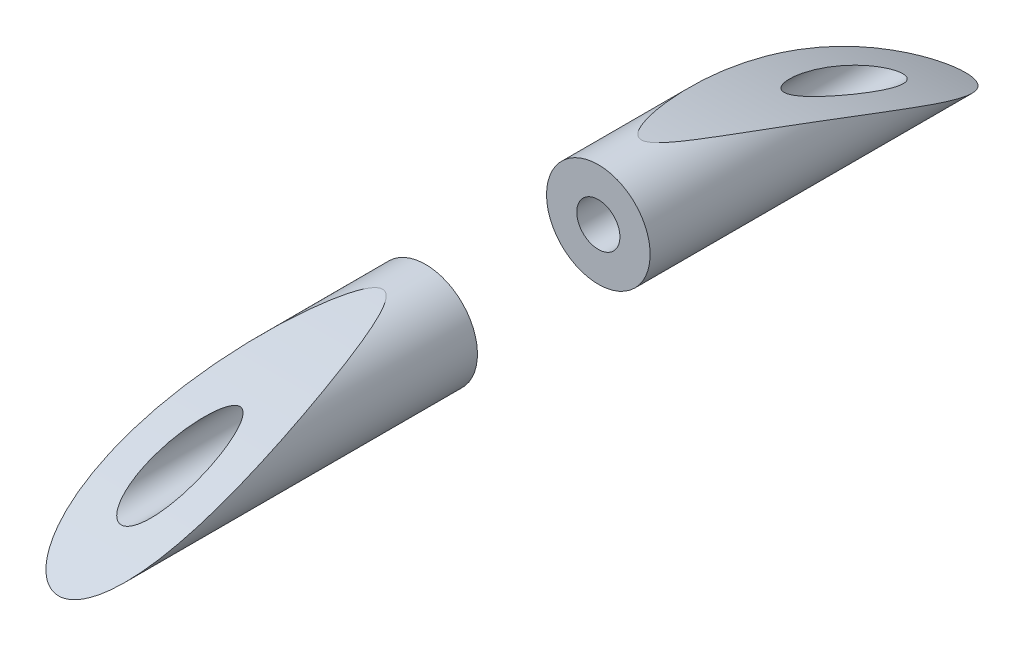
ISO-10303-21;
HEADER;
FILE_DESCRIPTION(('STEP AP214'),'2;1');
FILE_NAME('part.step','',(''),(''),'','','');
FILE_SCHEMA(('AUTOMOTIVE_DESIGN { 1 0 10303 214 1 1 1 1 }'));
ENDSEC;
DATA;
#1=APPLICATION_CONTEXT('core data for automotive mechanical design processes');
#2=APPLICATION_PROTOCOL_DEFINITION('international standard','automotive_design',2000,#1);
#3=PRODUCT_CONTEXT('',#1,'mechanical');
#4=PRODUCT('Part','Part','',(#3));
#5=PRODUCT_RELATED_PRODUCT_CATEGORY('part','',(#4));
#6=PRODUCT_DEFINITION_FORMATION('','',#4);
#7=PRODUCT_DEFINITION_CONTEXT('part definition',#1,'design');
#8=PRODUCT_DEFINITION('design','',#6,#7);
#9=PRODUCT_DEFINITION_SHAPE('','',#8);
#10=(LENGTH_UNIT() NAMED_UNIT(*) SI_UNIT(.MILLI.,.METRE.));
#11=(NAMED_UNIT(*) PLANE_ANGLE_UNIT() SI_UNIT($,.RADIAN.));
#12=(NAMED_UNIT(*) SI_UNIT($,.STERADIAN.) SOLID_ANGLE_UNIT());
#13=UNCERTAINTY_MEASURE_WITH_UNIT(LENGTH_MEASURE(1.E-05),#10,'distance_accuracy_value','');
#14=(GEOMETRIC_REPRESENTATION_CONTEXT(3) GLOBAL_UNCERTAINTY_ASSIGNED_CONTEXT((#13)) GLOBAL_UNIT_ASSIGNED_CONTEXT((#10,
#11,#12)) REPRESENTATION_CONTEXT('',''));
#15=CARTESIAN_POINT('',(0.,0.,0.));
#16=DIRECTION('',(0.,0.,1.));
#17=DIRECTION('',(1.,0.,0.));
#18=AXIS2_PLACEMENT_3D('',#15,#16,#17);
#19=CARTESIAN_POINT('',(0.,0.,10.5));
#20=DIRECTION('',(0.,0.,-1.));
#21=DIRECTION('',(-1.,0.,0.));
#22=AXIS2_PLACEMENT_3D('',#19,#20,#21);
#23=CYLINDRICAL_SURFACE('',#22,0.5);
#24=CARTESIAN_POINT('',(0.,0.,2.));
#25=DIRECTION('',(0.,0.,1.));
#26=DIRECTION('',(0.,-1.,0.));
#27=AXIS2_PLACEMENT_3D('',#24,#25,#26);
#28=CIRCLE('',#27,0.5);
#29=CARTESIAN_POINT('',(0.,-0.5,2.));
#30=VERTEX_POINT('',#29);
#31=EDGE_CURVE('E11',#30,#30,#28,.T.);
#32=ORIENTED_EDGE('',*,*,#31,.F.);
#33=EDGE_LOOP('',(#32));
#34=FACE_BOUND('',#33,.T.);
#35=CARTESIAN_POINT('',(-0.5,0.,7.81348853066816));
#36=CARTESIAN_POINT('',(-0.500001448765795,0.0291573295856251,7.73475115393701));
#37=CARTESIAN_POINT('',(-0.497465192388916,0.0578744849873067,7.65584777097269));
#38=CARTESIAN_POINT('',(-0.487597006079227,0.114324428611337,7.49800798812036));
#39=CARTESIAN_POINT('',(-0.48026587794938,0.142057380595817,7.4190715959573));
#40=CARTESIAN_POINT('',(-0.460633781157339,0.196628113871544,7.26094847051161));
#41=CARTESIAN_POINT('',(-0.448302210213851,0.223459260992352,7.18176323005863));
#42=CARTESIAN_POINT('',(-0.418091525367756,0.275902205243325,7.02413147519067));
#43=CARTESIAN_POINT('',(-0.40022022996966,0.301515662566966,6.94568407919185));
#44=CARTESIAN_POINT('',(-0.36795740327,0.33893520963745,6.82894699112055));
#45=CARTESIAN_POINT('',(-0.356254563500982,0.351273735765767,6.79008609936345));
#46=CARTESIAN_POINT('',(-0.330563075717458,0.375556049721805,6.71289235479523));
#47=CARTESIAN_POINT('',(-0.316569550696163,0.387498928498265,6.67456082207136));
#48=CARTESIAN_POINT('',(-0.285748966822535,0.410756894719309,6.59921824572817));
#49=CARTESIAN_POINT('',(-0.268947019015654,0.422076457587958,6.56219874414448));
#50=CARTESIAN_POINT('',(-0.240598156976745,0.438439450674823,6.50821051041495));
#51=CARTESIAN_POINT('',(-0.230644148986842,0.44378233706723,6.49050060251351));
#52=CARTESIAN_POINT('',(-0.20939341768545,0.454197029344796,6.45583050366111));
#53=CARTESIAN_POINT('',(-0.198098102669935,0.459269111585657,6.4388695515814));
#54=CARTESIAN_POINT('',(-0.173629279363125,0.469072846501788,6.40595294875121));
#55=CARTESIAN_POINT('',(-0.160437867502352,0.473800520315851,6.39000925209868));
#56=CARTESIAN_POINT('',(-0.13166804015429,0.482585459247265,6.36027398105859));
#57=CARTESIAN_POINT('',(-0.116107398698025,0.486647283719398,6.3464678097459));
#58=CARTESIAN_POINT('',(-0.0914505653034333,0.491625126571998,6.32950276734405));
#59=CARTESIAN_POINT('',(-0.0835964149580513,0.493031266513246,6.32470327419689));
#60=CARTESIAN_POINT('',(-0.0672596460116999,0.495524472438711,6.31618509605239));
#61=CARTESIAN_POINT('',(-0.0587769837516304,0.496611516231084,6.31246648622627));
#62=CARTESIAN_POINT('',(-0.0411612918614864,0.498382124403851,6.30640574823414));
#63=CARTESIAN_POINT('',(-0.0320216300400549,0.499060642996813,6.30408083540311));
#64=CARTESIAN_POINT('',(-0.0134492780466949,0.499905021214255,6.30118717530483));
#65=CARTESIAN_POINT('',(-0.00401712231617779,0.500071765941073,6.30061539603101));
#66=CARTESIAN_POINT('',(0.0136701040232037,0.499882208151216,6.3012651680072));
#67=CARTESIAN_POINT('',(0.0219340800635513,0.499584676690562,6.30228521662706));
#68=CARTESIAN_POINT('',(0.0381699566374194,0.498607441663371,6.30563344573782));
#69=CARTESIAN_POINT('',(0.0461415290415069,0.497927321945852,6.3079630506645));
#70=CARTESIAN_POINT('',(0.0645042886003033,0.495936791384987,6.31477496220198));
#71=CARTESIAN_POINT('',(0.074700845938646,0.494486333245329,6.31973466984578));
#72=CARTESIAN_POINT('',(0.0941618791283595,0.491153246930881,6.33111260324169));
#73=CARTESIAN_POINT('',(0.103423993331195,0.489269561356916,6.33753439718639));
#74=CARTESIAN_POINT('',(0.128190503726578,0.48356614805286,6.35693990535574));
#75=CARTESIAN_POINT('',(0.142723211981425,0.479407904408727,6.37104681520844));
#76=CARTESIAN_POINT('',(0.16966531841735,0.470546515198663,6.40098514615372));
#77=CARTESIAN_POINT('',(0.182067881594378,0.465841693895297,6.41682186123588));
#78=CARTESIAN_POINT('',(0.211578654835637,0.453446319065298,6.45836433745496));
#79=CARTESIAN_POINT('',(0.227594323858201,0.445519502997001,6.48476721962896));
#80=CARTESIAN_POINT('',(0.257083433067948,0.42917327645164,6.53883186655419));
#81=CARTESIAN_POINT('',(0.27055092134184,0.420752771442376,6.56649639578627));
#82=CARTESIAN_POINT('',(0.29564659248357,0.403516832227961,6.62272138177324));
#83=CARTESIAN_POINT('',(0.30726403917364,0.394699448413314,6.65128599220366));
#84=CARTESIAN_POINT('',(0.328967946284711,0.376798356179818,6.70886235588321));
#85=CARTESIAN_POINT('',(0.339056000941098,0.367714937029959,6.7378736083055));
#86=CARTESIAN_POINT('',(0.363256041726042,0.344192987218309,6.81246121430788));
#87=CARTESIAN_POINT('',(0.376483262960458,0.329587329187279,6.85827172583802));
#88=CARTESIAN_POINT('',(0.400532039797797,0.299894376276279,6.95036837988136));
#89=CARTESIAN_POINT('',(0.411352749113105,0.284806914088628,6.99665468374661));
#90=CARTESIAN_POINT('',(0.440779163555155,0.238845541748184,7.13610338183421));
#91=CARTESIAN_POINT('',(0.456304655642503,0.20731889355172,7.22970870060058));
#92=CARTESIAN_POINT('',(0.480375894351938,0.142866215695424,7.416946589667));
#93=CARTESIAN_POINT('',(0.488944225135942,0.109945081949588,7.51057807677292));
#94=CARTESIAN_POINT('',(0.499331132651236,0.0427370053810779,7.69773825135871));
#95=CARTESIAN_POINT('',(0.501150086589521,0.00845013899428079,7.79126694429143));
#96=CARTESIAN_POINT('',(0.49778461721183,-0.055033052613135,7.96094278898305));
#97=CARTESIAN_POINT('',(0.493802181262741,-0.0840344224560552,8.03718748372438));
#98=CARTESIAN_POINT('',(0.480147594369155,-0.142729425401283,8.18901450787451));
#99=CARTESIAN_POINT('',(0.470470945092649,-0.1724235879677,8.26459626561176));
#100=CARTESIAN_POINT('',(0.450272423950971,-0.218057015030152,8.37894755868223));
#101=CARTESIAN_POINT('',(0.442313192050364,-0.233861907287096,8.41822671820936));
#102=CARTESIAN_POINT('',(0.424080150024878,-0.265500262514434,8.49622611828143));
#103=CARTESIAN_POINT('',(0.41380722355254,-0.281333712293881,8.53494656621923));
#104=CARTESIAN_POINT('',(0.39047735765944,-0.312910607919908,8.61156646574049));
#105=CARTESIAN_POINT('',(0.377421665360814,-0.3286540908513,8.64946627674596));
#106=CARTESIAN_POINT('',(0.34781938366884,-0.359840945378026,8.72398115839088));
#107=CARTESIAN_POINT('',(0.331278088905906,-0.375284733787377,8.76059808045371));
#108=CARTESIAN_POINT('',(0.296744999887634,-0.402920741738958,8.8256638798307));
#109=CARTESIAN_POINT('',(0.27947392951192,-0.415220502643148,8.85444545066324));
#110=CARTESIAN_POINT('',(0.240711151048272,-0.438833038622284,8.90940169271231));
#111=CARTESIAN_POINT('',(0.219243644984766,-0.450150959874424,8.93559007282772));
#112=CARTESIAN_POINT('',(0.184263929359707,-0.464949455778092,8.96968174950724));
#113=CARTESIAN_POINT('',(0.173068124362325,-0.469257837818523,8.9795850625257));
#114=CARTESIAN_POINT('',(0.149414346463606,-0.477317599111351,8.99807948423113));
#115=CARTESIAN_POINT('',(0.136955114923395,-0.481068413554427,9.00666926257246));
#116=CARTESIAN_POINT('',(0.110538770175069,-0.487821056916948,9.02211225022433));
#117=CARTESIAN_POINT('',(0.0965631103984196,-0.490811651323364,9.02893943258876));
#118=CARTESIAN_POINT('',(0.0674345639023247,-0.495649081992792,9.03997314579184));
#119=CARTESIAN_POINT('',(0.0522858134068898,-0.497499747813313,9.04418845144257));
#120=CARTESIAN_POINT('',(0.0254925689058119,-0.499479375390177,9.04869637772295));
#121=CARTESIAN_POINT('',(0.0139969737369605,-0.499936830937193,9.04973751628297));
#122=CARTESIAN_POINT('',(-0.00902019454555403,-0.500050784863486,9.04999691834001));
#123=CARTESIAN_POINT('',(-0.0205417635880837,-0.499707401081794,9.04921545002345));
#124=CARTESIAN_POINT('',(-0.0432373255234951,-0.498256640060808,9.04591212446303));
#125=CARTESIAN_POINT('',(-0.05441232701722,-0.497151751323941,9.04339593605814));
#126=CARTESIAN_POINT('',(-0.0762163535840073,-0.494279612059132,9.03684981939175));
#127=CARTESIAN_POINT('',(-0.0868449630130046,-0.492511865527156,9.03281875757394));
#128=CARTESIAN_POINT('',(-0.112816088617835,-0.487368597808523,9.02107774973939));
#129=CARTESIAN_POINT('',(-0.127714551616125,-0.483635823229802,9.01254654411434));
#130=CARTESIAN_POINT('',(-0.155888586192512,-0.4753059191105,8.9934680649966));
#131=CARTESIAN_POINT('',(-0.169159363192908,-0.470706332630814,8.98291505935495));
#132=CARTESIAN_POINT('',(-0.20376782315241,-0.457212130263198,8.95187924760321));
#133=CARTESIAN_POINT('',(-0.223557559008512,-0.447713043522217,8.92995207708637));
#134=CARTESIAN_POINT('',(-0.259619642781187,-0.427809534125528,8.88378133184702));
#135=CARTESIAN_POINT('',(-0.275882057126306,-0.417402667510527,8.8595314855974));
#136=CARTESIAN_POINT('',(-0.307073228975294,-0.395103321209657,8.80730018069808));
#137=CARTESIAN_POINT('',(-0.321735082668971,-0.383162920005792,8.77918182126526));
#138=CARTESIAN_POINT('',(-0.348516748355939,-0.358970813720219,8.72187502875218));
#139=CARTESIAN_POINT('',(-0.360633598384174,-0.346718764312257,8.69268539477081));
#140=CARTESIAN_POINT('',(-0.393946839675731,-0.309706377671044,8.60396617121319));
#141=CARTESIAN_POINT('',(-0.412059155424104,-0.28472684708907,8.54337285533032));
#142=CARTESIAN_POINT('',(-0.440665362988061,-0.237646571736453,8.42770195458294));
#143=CARTESIAN_POINT('',(-0.451787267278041,-0.215538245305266,8.37277113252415));
#144=CARTESIAN_POINT('',(-0.470262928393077,-0.171532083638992,8.26216004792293));
#145=CARTESIAN_POINT('',(-0.477614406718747,-0.149634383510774,8.2064793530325));
#146=CARTESIAN_POINT('',(-0.489104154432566,-0.106207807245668,8.09474086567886));
#147=CARTESIAN_POINT('',(-0.493246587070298,-0.084678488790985,8.03868365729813));
#148=CARTESIAN_POINT('',(-0.498694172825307,-0.0420240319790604,7.92627559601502));
#149=CARTESIAN_POINT('',(-0.499998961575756,-0.0208989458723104,7.86992470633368));
#150=CARTESIAN_POINT('',(-0.5,0.,7.81348853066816));
#151=B_SPLINE_CURVE_WITH_KNOTS('',3,(#35,#36,#37,#38,#39,#40,#41,#42,#43,#44,#45,#46,#47,#48,
#49,#50,#51,#52,#53,#54,#55,#56,#57,#58,#59,#60,#61,#62,#63,#64,#65,#66,#67,#68,#69,#70,#71,#72,
#73,#74,#75,#76,#77,#78,#79,#80,#81,#82,#83,#84,#85,#86,#87,#88,#89,#90,#91,#92,#93,#94,#95,#96,
#97,#98,#99,#100,#101,#102,#103,#104,#105,#106,#107,#108,#109,#110,#111,#112,#113,#114,#115,
#116,#117,#118,#119,#120,#121,#122,#123,#124,#125,#126,#127,#128,#129,#130,#131,#132,#133,#134,
#135,#136,#137,#138,#139,#140,#141,#142,#143,#144,#145,#146,#147,#148,#149,#150),.UNSPECIFIED.,
.T.,.F.,(4,2,2,2,2,2,2,2,2,2,2,2,2,2,2,2,2,2,2,2,2,2,2,2,2,2,2,2,2,2,2,2,2,2,2,2,2,2,2,2,2,2,2,
2,2,2,2,2,2,2,2,2,2,2,2,2,2,4),(0.,0.251859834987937,0.503677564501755,0.757060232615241,
1.01008690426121,1.13729267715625,1.2647728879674,1.39116889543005,1.45414921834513,
1.51706399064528,1.58061748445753,1.64371576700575,1.67158102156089,1.69944821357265,
1.72765289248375,1.75580876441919,1.78067871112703,1.80557576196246,1.83967454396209,
1.87385745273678,1.9355364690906,1.99740984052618,2.09281557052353,2.18844146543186,
2.2846035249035,2.38066464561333,2.53018231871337,2.67975248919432,2.97937197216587,
3.27801490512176,3.57664114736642,3.8214999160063,4.06655237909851,4.19574643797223,
4.32489123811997,4.45397828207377,4.58287063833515,4.68992252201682,4.79637431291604,
4.84295482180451,4.88958219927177,4.93686310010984,4.98398428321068,5.018477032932,
5.05296470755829,5.08734021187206,5.12174149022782,5.17414641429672,5.22670217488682,
5.31925926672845,5.41207372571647,5.51356711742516,5.61517798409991,5.81871252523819,
5.9993394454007,6.18007539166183,6.36057646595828,6.541100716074),.UNSPECIFIED.);
#152=CARTESIAN_POINT('',(-0.5,0.,7.81348853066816));
#153=VERTEX_POINT('',#152);
#154=EDGE_CURVE('E47',#153,#153,#151,.T.);
#155=ORIENTED_EDGE('',*,*,#154,.F.);
#156=EDGE_LOOP('',(#155));
#157=FACE_BOUND('',#156,.T.);
#158=ADVANCED_FACE('F39',(#34,#157),#23,.F.);
#159=CARTESIAN_POINT('',(0.,0.,10.5));
#160=DIRECTION('',(0.,0.,-1.));
#161=DIRECTION('',(-1.,0.,0.));
#162=AXIS2_PLACEMENT_3D('',#159,#160,#161);
#163=CYLINDRICAL_SURFACE('',#162,1.2);
#164=CARTESIAN_POINT('',(0.,-1.19999999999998,10.5));
#165=CARTESIAN_POINT('',(-0.033764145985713,-1.19999774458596,10.499995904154));
#166=CARTESIAN_POINT('',(-0.0675697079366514,-1.19855851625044,10.4972694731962));
#167=CARTESIAN_POINT('',(-0.13414225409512,-1.19294985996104,10.4866291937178));
#168=CARTESIAN_POINT('',(-0.166906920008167,-1.18877473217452,10.4787045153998));
#169=CARTESIAN_POINT('',(-0.237566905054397,-1.1769071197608,10.4561262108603));
#170=CARTESIAN_POINT('',(-0.27501344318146,-1.16864440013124,10.4403786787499));
#171=CARTESIAN_POINT('',(-0.346515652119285,-1.14948018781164,10.403711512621));
#172=CARTESIAN_POINT('',(-0.380565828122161,-1.13857451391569,10.3827836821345));
#173=CARTESIAN_POINT('',(-0.462778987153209,-1.1084507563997,10.3247064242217));
#174=CARTESIAN_POINT('',(-0.508577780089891,-1.0879326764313,10.2849157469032));
#175=CARTESIAN_POINT('',(-0.593011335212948,-1.04431999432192,10.1996123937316));
#176=CARTESIAN_POINT('',(-0.63162737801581,-1.02121890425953,10.1540852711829));
#177=CARTESIAN_POINT('',(-0.700809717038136,-0.97493189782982,10.0620202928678));
#178=CARTESIAN_POINT('',(-0.731709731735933,-0.951826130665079,10.0156885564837));
#179=CARTESIAN_POINT('',(-0.789040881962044,-0.904869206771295,9.92066805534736));
#180=CARTESIAN_POINT('',(-0.815467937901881,-0.88101739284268,9.87197719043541));
#181=CARTESIAN_POINT('',(-0.864548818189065,-0.832909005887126,9.77283214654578));
#182=CARTESIAN_POINT('',(-0.887196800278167,-0.808651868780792,9.72237538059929));
#183=CARTESIAN_POINT('',(-0.92921262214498,-0.759996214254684,9.62017039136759));
#184=CARTESIAN_POINT('',(-0.948579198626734,-0.735597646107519,9.5684216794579));
#185=CARTESIAN_POINT('',(-1.00582822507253,-0.657820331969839,9.40177953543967));
#186=CARTESIAN_POINT('',(-1.0383294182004,-0.604495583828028,9.28500377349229));
#187=CARTESIAN_POINT('',(-1.09294276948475,-0.498989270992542,9.04851051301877));
#188=CARTESIAN_POINT('',(-1.11504307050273,-0.446809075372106,8.92878981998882));
#189=CARTESIAN_POINT('',(-1.15092913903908,-0.343994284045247,8.68711353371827));
#190=CARTESIAN_POINT('',(-1.16469363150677,-0.293363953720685,8.56515303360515));
#191=CARTESIAN_POINT('',(-1.18528100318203,-0.194098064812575,8.31993202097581));
#192=CARTESIAN_POINT('',(-1.19210685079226,-0.145461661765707,8.1966720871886));
#193=CARTESIAN_POINT('',(-1.20034460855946,-0.044818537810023,7.93484668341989));
#194=CARTESIAN_POINT('',(-1.20103915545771,0.00692751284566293,7.79615961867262));
#195=CARTESIAN_POINT('',(-1.19622454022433,0.107644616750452,7.5178703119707));
#196=CARTESIAN_POINT('',(-1.19071400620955,0.156615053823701,7.37826787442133));
#197=CARTESIAN_POINT('',(-1.17428914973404,0.251747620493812,7.09827358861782));
#198=CARTESIAN_POINT('',(-1.16336929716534,0.297906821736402,6.95788107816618));
#199=CARTESIAN_POINT('',(-1.13672844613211,0.387330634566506,6.6766159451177));
#200=CARTESIAN_POINT('',(-1.12100681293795,0.430594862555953,6.53574326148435));
#201=CARTESIAN_POINT('',(-1.08521080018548,0.514182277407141,6.25376678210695));
#202=CARTESIAN_POINT('',(-1.06513878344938,0.554507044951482,6.1126631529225));
#203=CARTESIAN_POINT('',(-1.02092224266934,0.632231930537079,5.83030489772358));
#204=CARTESIAN_POINT('',(-0.996778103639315,0.669632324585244,5.68905028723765));
#205=CARTESIAN_POINT('',(-0.944548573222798,0.74148451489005,5.40663888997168));
#206=CARTESIAN_POINT('',(-0.916466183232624,0.775938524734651,5.26548211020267));
#207=CARTESIAN_POINT('',(-0.856248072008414,0.841925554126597,4.98336297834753));
#208=CARTESIAN_POINT('',(-0.824112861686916,0.87345894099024,4.84240060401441));
#209=CARTESIAN_POINT('',(-0.770787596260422,0.920062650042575,4.62430219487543));
#210=CARTESIAN_POINT('',(-0.751181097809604,0.936154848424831,4.54699443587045));
#211=CARTESIAN_POINT('',(-0.710424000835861,0.967449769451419,4.39260202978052));
#212=CARTESIAN_POINT('',(-0.689273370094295,0.98265247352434,4.31551738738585));
#213=CARTESIAN_POINT('',(-0.645187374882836,1.01214438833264,4.16176680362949));
#214=CARTESIAN_POINT('',(-0.622253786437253,1.02643448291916,4.08510052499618));
#215=CARTESIAN_POINT('',(-0.574149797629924,1.05409873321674,3.93231060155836));
#216=CARTESIAN_POINT('',(-0.548979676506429,1.06747300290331,3.85618689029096));
#217=CARTESIAN_POINT('',(-0.503394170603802,1.08951177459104,3.72688531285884));
#218=CARTESIAN_POINT('',(-0.483731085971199,1.09841287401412,3.67348615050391));
#219=CARTESIAN_POINT('',(-0.442389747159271,1.11570099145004,3.56744796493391));
#220=CARTESIAN_POINT('',(-0.420713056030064,1.12408839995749,3.51480838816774));
#221=CARTESIAN_POINT('',(-0.368431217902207,1.14247427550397,3.39675235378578));
#222=CARTESIAN_POINT('',(-0.336983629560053,1.15230917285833,3.33165461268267));
#223=CARTESIAN_POINT('',(-0.283516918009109,1.16616801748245,3.23728000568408));
#224=CARTESIAN_POINT('',(-0.264609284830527,1.17064531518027,3.20631910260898));
#225=CARTESIAN_POINT('',(-0.223621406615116,1.17916972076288,3.1465349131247));
#226=CARTESIAN_POINT('',(-0.201554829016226,1.1832185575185,3.11770318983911));
#227=CARTESIAN_POINT('',(-0.167734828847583,1.18825396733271,3.08140182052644));
#228=CARTESIAN_POINT('',(-0.158231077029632,1.18956409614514,3.07190774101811));
#229=CARTESIAN_POINT('',(-0.138312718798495,1.19204497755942,3.05385246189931));
#230=CARTESIAN_POINT('',(-0.127896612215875,1.19321549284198,3.04529285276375));
#231=CARTESIAN_POINT('',(-0.105870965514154,1.19537253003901,3.02946070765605));
#232=CARTESIAN_POINT('',(-0.0942472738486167,1.19635636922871,3.0222070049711));
#233=CARTESIAN_POINT('',(-0.0698819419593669,1.19802488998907,3.00987212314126));
#234=CARTESIAN_POINT('',(-0.0571450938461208,1.19871078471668,3.00478213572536));
#235=CARTESIAN_POINT('',(-0.0350480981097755,1.19952149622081,2.99875857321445));
#236=CARTESIAN_POINT('',(-0.0259145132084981,1.19975569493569,2.99701562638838));
#237=CARTESIAN_POINT('',(-0.00748062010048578,1.20001195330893,2.9951083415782));
#238=CARTESIAN_POINT('',(0.0018195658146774,1.20003416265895,2.99494288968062));
#239=CARTESIAN_POINT('',(0.0202957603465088,1.19986394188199,2.99621001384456));
#240=CARTESIAN_POINT('',(0.029471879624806,1.19967171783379,2.99764105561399));
#241=CARTESIAN_POINT('',(0.0474761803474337,1.19909442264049,3.00193240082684));
#242=CARTESIAN_POINT('',(0.0563039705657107,1.19870914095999,3.00479426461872));
#243=CARTESIAN_POINT('',(0.0776782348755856,1.19755183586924,3.01337237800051));
#244=CARTESIAN_POINT('',(0.0899306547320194,1.19668282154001,3.0198001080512));
#245=CARTESIAN_POINT('',(0.113300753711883,1.19469690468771,3.03442730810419));
#246=CARTESIAN_POINT('',(0.124415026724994,1.19357928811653,3.04263187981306));
#247=CARTESIAN_POINT('',(0.160676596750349,1.18947788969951,3.07259196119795));
#248=CARTESIAN_POINT('',(0.183446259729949,1.18608979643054,3.09710514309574));
#249=CARTESIAN_POINT('',(0.225428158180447,1.17882491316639,3.14894690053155));
#250=CARTESIAN_POINT('',(0.24461500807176,1.17494494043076,3.17629357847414));
#251=CARTESIAN_POINT('',(0.296411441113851,1.16333791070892,3.25695675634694));
#252=CARTESIAN_POINT('',(0.32609437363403,1.15521257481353,3.31207951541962));
#253=CARTESIAN_POINT('',(0.381146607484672,1.13821500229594,3.4243601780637));
#254=CARTESIAN_POINT('',(0.406503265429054,1.12934068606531,3.48152347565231));
#255=CARTESIAN_POINT('',(0.454404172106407,1.1109357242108,3.59707074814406));
#256=CARTESIAN_POINT('',(0.476942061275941,1.10140366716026,3.65545714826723));
#257=CARTESIAN_POINT('',(0.519936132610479,1.08176693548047,3.77278446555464));
#258=CARTESIAN_POINT('',(0.540395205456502,1.07166308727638,3.83172448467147));
#259=CARTESIAN_POINT('',(0.599257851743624,1.04060813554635,4.00859910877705));
#260=CARTESIAN_POINT('',(0.635366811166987,1.01882416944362,4.12715146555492));
#261=CARTESIAN_POINT('',(0.703368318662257,0.973106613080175,4.36506071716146));
#262=CARTESIAN_POINT('',(0.735259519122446,0.949172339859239,4.48441785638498));
#263=CARTESIAN_POINT('',(0.795661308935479,0.8991461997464,4.72372547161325));
#264=CARTESIAN_POINT('',(0.824166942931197,0.873051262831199,4.84367655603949));
#265=CARTESIAN_POINT('',(0.878135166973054,0.818742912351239,5.08378618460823));
#266=CARTESIAN_POINT('',(0.903597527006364,0.79052933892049,5.20394474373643));
#267=CARTESIAN_POINT('',(0.975624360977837,0.702779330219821,5.56424444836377));
#268=CARTESIAN_POINT('',(1.01789876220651,0.640074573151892,5.80449267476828));
#269=CARTESIAN_POINT('',(1.09062265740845,0.50628376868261,6.28421208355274));
#270=CARTESIAN_POINT('',(1.12108301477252,0.435205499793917,6.52368377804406));
#271=CARTESIAN_POINT('',(1.16317574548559,0.301319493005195,6.94854833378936));
#272=CARTESIAN_POINT('',(1.17748179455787,0.240157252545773,7.13419266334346));
#273=CARTESIAN_POINT('',(1.19642157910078,0.112805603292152,7.50439056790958));
#274=CARTESIAN_POINT('',(1.20104968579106,0.0466132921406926,7.68894344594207));
#275=CARTESIAN_POINT('',(1.19854694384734,-0.0906137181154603,8.05634371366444));
#276=CARTESIAN_POINT('',(1.19141079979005,-0.161650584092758,8.23919029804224));
#277=CARTESIAN_POINT('',(1.16949481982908,-0.271407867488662,8.51115629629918));
#278=CARTESIAN_POINT('',(1.16032694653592,-0.308511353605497,8.60139096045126));
#279=CARTESIAN_POINT('',(1.13768540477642,-0.383687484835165,8.78090345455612));
#280=CARTESIAN_POINT('',(1.12421263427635,-0.421759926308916,8.87018148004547));
#281=CARTESIAN_POINT('',(1.09213848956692,-0.498993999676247,9.04811449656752));
#282=CARTESIAN_POINT('',(1.07350179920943,-0.538161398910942,9.13676072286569));
#283=CARTESIAN_POINT('',(1.03015046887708,-0.617107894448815,9.31239460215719));
#284=CARTESIAN_POINT('',(1.00543124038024,-0.656887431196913,9.39938094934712));
#285=CARTESIAN_POINT('',(0.948722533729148,-0.736411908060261,9.57044227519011));
#286=CARTESIAN_POINT('',(0.916769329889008,-0.776156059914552,9.65452944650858));
#287=CARTESIAN_POINT('',(0.843691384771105,-0.855033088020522,9.81884619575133));
#288=CARTESIAN_POINT('',(0.802584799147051,-0.894167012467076,9.89908303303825));
#289=CARTESIAN_POINT('',(0.719375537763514,-0.961590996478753,10.0353864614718));
#290=CARTESIAN_POINT('',(0.679728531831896,-0.990286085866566,10.0927340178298));
#291=CARTESIAN_POINT('',(0.591674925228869,-1.04528097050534,10.2015679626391));
#292=CARTESIAN_POINT('',(0.543296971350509,-1.07158818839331,10.2530726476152));
#293=CARTESIAN_POINT('',(0.459287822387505,-1.10912084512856,10.3259716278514));
#294=CARTESIAN_POINT('',(0.427284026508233,-1.12192410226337,10.3507089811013));
#295=CARTESIAN_POINT('',(0.359618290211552,-1.14540577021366,10.3959049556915));
#296=CARTESIAN_POINT('',(0.323958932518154,-1.15608566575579,10.4163665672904));
#297=CARTESIAN_POINT('',(0.255590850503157,-1.17289822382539,10.44848799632));
#298=CARTESIAN_POINT('',(0.22342868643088,-1.17949697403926,10.4610562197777));
#299=CARTESIAN_POINT('',(0.157217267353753,-1.1901250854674,10.4812699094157));
#300=CARTESIAN_POINT('',(0.123173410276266,-1.1941614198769,10.4889287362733));
#301=CARTESIAN_POINT('',(0.0740039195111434,-1.19780688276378,10.4958427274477));
#302=CARTESIAN_POINT('',(0.0592620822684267,-1.19862707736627,10.4973976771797));
#303=CARTESIAN_POINT('',(0.0296828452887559,-1.19972418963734,10.4994773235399));
#304=CARTESIAN_POINT('',(0.0148454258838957,-1.20000099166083,10.5000018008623));
#305=CARTESIAN_POINT('',(0.,-1.19999999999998,10.5));
#306=B_SPLINE_CURVE_WITH_KNOTS('',3,(#164,#165,#166,#167,#168,#169,#170,#171,#172,#173,#174,
#175,#176,#177,#178,#179,#180,#181,#182,#183,#184,#185,#186,#187,#188,#189,#190,#191,#192,#193,
#194,#195,#196,#197,#198,#199,#200,#201,#202,#203,#204,#205,#206,#207,#208,#209,#210,#211,#212,
#213,#214,#215,#216,#217,#218,#219,#220,#221,#222,#223,#224,#225,#226,#227,#228,#229,#230,#231,
#232,#233,#234,#235,#236,#237,#238,#239,#240,#241,#242,#243,#244,#245,#246,#247,#248,#249,#250,
#251,#252,#253,#254,#255,#256,#257,#258,#259,#260,#261,#262,#263,#264,#265,#266,#267,#268,#269,
#270,#271,#272,#273,#274,#275,#276,#277,#278,#279,#280,#281,#282,#283,#284,#285,#286,#287,#288,
#289,#290,#291,#292,#293,#294,#295,#296,#297,#298,#299,#300,#301,#302,#303,#304,#305),
.UNSPECIFIED.,.T.,.F.,(4,2,2,2,2,2,2,2,2,2,2,2,2,2,2,2,2,2,2,2,2,2,2,2,2,2,2,2,2,2,2,2,2,2,2,2,
2,2,2,2,2,2,2,2,2,2,2,2,2,2,2,2,2,2,2,2,2,2,2,2,2,2,2,2,2,2,2,2,2,2,4),(0.,0.101230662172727,
0.202672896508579,0.326341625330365,0.450207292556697,0.641265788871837,0.832815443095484,
1.01342855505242,1.19420551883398,1.37525941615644,1.5563828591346,1.9529784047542,
2.35002498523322,2.74808070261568,3.14596605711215,3.58986379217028,4.03385968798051,
4.47831043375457,4.92281995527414,5.36708865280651,5.8113153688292,6.25520535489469,
6.69903943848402,6.94311124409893,7.18718814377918,7.43102495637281,7.67483136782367,
7.84757942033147,8.020194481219,8.23864340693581,8.34822759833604,8.45735124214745,
8.4977973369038,8.53831123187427,8.57936933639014,8.6202586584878,8.64803899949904,
8.6757997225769,8.70353378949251,8.73129816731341,8.77264824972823,8.81411866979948,
8.91422468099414,9.01501509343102,9.20390507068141,9.3933379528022,9.58319079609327,
9.77277592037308,10.150115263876,10.5275748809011,10.9055803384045,11.283614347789,
12.038791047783,12.7932716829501,13.3809550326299,13.9689800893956,14.5572699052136,
14.8511728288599,15.145014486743,15.4409175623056,15.737044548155,16.0317182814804,
16.3258126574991,16.5515006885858,16.776461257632,16.9034267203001,17.0303030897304,
17.1353686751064,17.2401471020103,17.2846467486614,17.3291558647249),.UNSPECIFIED.);
#307=CARTESIAN_POINT('',(0.,-1.19999999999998,10.5));
#308=VERTEX_POINT('',#307);
#309=EDGE_CURVE('E56',#308,#308,#306,.T.);
#310=ORIENTED_EDGE('',*,*,#309,.T.);
#311=EDGE_LOOP('',(#310));
#312=FACE_BOUND('',#311,.T.);
#313=CARTESIAN_POINT('',(0.,0.,2.));
#314=DIRECTION('',(0.,0.,1.));
#315=DIRECTION('',(0.,-1.,0.));
#316=AXIS2_PLACEMENT_3D('',#313,#314,#315);
#317=CIRCLE('',#316,1.2);
#318=CARTESIAN_POINT('',(0.,-1.2,2.));
#319=VERTEX_POINT('',#318);
#320=EDGE_CURVE('E51',#319,#319,#317,.T.);
#321=ORIENTED_EDGE('',*,*,#320,.T.);
#322=EDGE_LOOP('',(#321));
#323=FACE_BOUND('',#322,.T.);
#324=ADVANCED_FACE('F41',(#312,#323),#163,.T.);
#325=CARTESIAN_POINT('',(21.,-21.0997487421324,0.));
#326=DIRECTION('',(-1.,0.,0.));
#327=DIRECTION('',(0.,0.,1.));
#328=AXIS2_PLACEMENT_3D('',#325,#326,#327);
#329=CYLINDRICAL_SURFACE('',#328,22.5);
#330=ORIENTED_EDGE('',*,*,#154,.T.);
#331=EDGE_LOOP('',(#330));
#332=FACE_BOUND('',#331,.T.);
#333=ORIENTED_EDGE('',*,*,#309,.F.);
#334=EDGE_LOOP('',(#333));
#335=FACE_BOUND('',#334,.T.);
#336=ADVANCED_FACE('F65',(#332,#335),#329,.T.);
#337=CARTESIAN_POINT('',(-1.2,5.01827247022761,2.));
#338=DIRECTION('',(0.,0.,1.));
#339=DIRECTION('',(0.,-1.,0.));
#340=AXIS2_PLACEMENT_3D('',#337,#338,#339);
#341=PLANE('',#340);
#342=ORIENTED_EDGE('',*,*,#31,.T.);
#343=EDGE_LOOP('',(#342));
#344=FACE_BOUND('',#343,.T.);
#345=ORIENTED_EDGE('',*,*,#320,.F.);
#346=EDGE_LOOP('',(#345));
#347=FACE_BOUND('',#346,.T.);
#348=ADVANCED_FACE('F68',(#344,#347),#341,.F.);
#349=CLOSED_SHELL('',(#158,#324,#336,#348));
#350=MANIFOLD_SOLID_BREP('B2',#349);
#351=CARTESIAN_POINT('',(0.,0.,10.5));
#352=DIRECTION('',(0.,0.,-1.));
#353=DIRECTION('',(-1.,0.,0.));
#354=AXIS2_PLACEMENT_3D('',#351,#352,#353);
#355=CYLINDRICAL_SURFACE('',#354,0.5);
#356=CARTESIAN_POINT('',(0.,0.,-2.));
#357=DIRECTION('',(0.,0.,-1.));
#358=DIRECTION('',(0.,1.,0.));
#359=AXIS2_PLACEMENT_3D('',#356,#357,#358);
#360=CIRCLE('',#359,0.5);
#361=CARTESIAN_POINT('',(0.,0.5,-2.));
#362=VERTEX_POINT('',#361);
#363=EDGE_CURVE('E126',#362,#362,#360,.T.);
#364=ORIENTED_EDGE('',*,*,#363,.F.);
#365=EDGE_LOOP('',(#364));
#366=FACE_BOUND('',#365,.T.);
#367=CARTESIAN_POINT('',(-0.5,0.,-7.81348853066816));
#368=CARTESIAN_POINT('',(-0.499998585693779,-0.0247696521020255,-7.88037735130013));
#369=CARTESIAN_POINT('',(-0.498168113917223,-0.0498572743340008,-7.94714693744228));
#370=CARTESIAN_POINT('',(-0.490451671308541,-0.100578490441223,-8.08021742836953));
#371=CARTESIAN_POINT('',(-0.484567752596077,-0.126211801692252,-8.14651855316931));
#372=CARTESIAN_POINT('',(-0.468076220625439,-0.177876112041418,-8.27829976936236));
#373=CARTESIAN_POINT('',(-0.45747435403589,-0.203906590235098,-8.34378076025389));
#374=CARTESIAN_POINT('',(-0.43042594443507,-0.256129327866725,-8.47339344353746));
#375=CARTESIAN_POINT('',(-0.413988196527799,-0.282321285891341,-8.53752701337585));
#376=CARTESIAN_POINT('',(-0.377896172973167,-0.32839642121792,-8.6489109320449));
#377=CARTESIAN_POINT('',(-0.359863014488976,-0.348338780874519,-8.69663793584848));
#378=CARTESIAN_POINT('',(-0.327998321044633,-0.377652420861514,-8.76614839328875));
#379=CARTESIAN_POINT('',(-0.31660338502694,-0.387303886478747,-8.78892592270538));
#380=CARTESIAN_POINT('',(-0.291853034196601,-0.40628340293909,-8.83352001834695));
#381=CARTESIAN_POINT('',(-0.278499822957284,-0.415611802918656,-8.85533762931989));
#382=CARTESIAN_POINT('',(-0.253854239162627,-0.430926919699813,-8.89100991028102));
#383=CARTESIAN_POINT('',(-0.243199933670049,-0.437055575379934,-8.90524206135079));
#384=CARTESIAN_POINT('',(-0.220492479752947,-0.448940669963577,-8.93276834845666));
#385=CARTESIAN_POINT('',(-0.208437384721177,-0.454696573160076,-8.9460611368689));
#386=CARTESIAN_POINT('',(-0.182578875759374,-0.4656872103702,-8.97138209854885));
#387=CARTESIAN_POINT('',(-0.168759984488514,-0.47091649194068,-8.9833971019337));
#388=CARTESIAN_POINT('',(-0.139240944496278,-0.480469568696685,-9.00530223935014));
#389=CARTESIAN_POINT('',(-0.123545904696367,-0.484795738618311,-9.0151979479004));
#390=CARTESIAN_POINT('',(-0.0959642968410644,-0.490832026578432,-9.02898599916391));
#391=CARTESIAN_POINT('',(-0.0846147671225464,-0.492930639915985,-9.03377363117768));
#392=CARTESIAN_POINT('',(-0.0612255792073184,-0.496377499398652,-9.04163214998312));
#393=CARTESIAN_POINT('',(-0.049186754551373,-0.497726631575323,-9.0447050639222));
#394=CARTESIAN_POINT('',(-0.0246020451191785,-0.499547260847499,-9.04885100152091));
#395=CARTESIAN_POINT('',(-0.0120530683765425,-0.500012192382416,-9.04990906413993));
#396=CARTESIAN_POINT('',(0.0130399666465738,-0.4999873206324,-9.04985245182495));
#397=CARTESIAN_POINT('',(0.0255840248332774,-0.499497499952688,-9.04873773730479));
#398=CARTESIAN_POINT('',(0.0491366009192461,-0.497707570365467,-9.04466161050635));
#399=CARTESIAN_POINT('',(0.0601822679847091,-0.496483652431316,-9.04187382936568));
#400=CARTESIAN_POINT('',(0.0817006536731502,-0.493399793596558,-9.03484353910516));
#401=CARTESIAN_POINT('',(0.0921730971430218,-0.491539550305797,-9.0306003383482));
#402=CARTESIAN_POINT('',(0.118306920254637,-0.486077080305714,-9.01812669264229));
#403=CARTESIAN_POINT('',(0.133462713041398,-0.482089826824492,-9.00901001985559));
#404=CARTESIAN_POINT('',(0.162062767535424,-0.473245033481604,-8.98874121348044));
#405=CARTESIAN_POINT('',(0.175501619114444,-0.468384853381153,-8.9775829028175));
#406=CARTESIAN_POINT('',(0.210839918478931,-0.454035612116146,-8.94455453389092));
#407=CARTESIAN_POINT('',(0.231055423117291,-0.443918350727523,-8.92117561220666));
#408=CARTESIAN_POINT('',(0.267774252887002,-0.422781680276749,-8.87207745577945));
#409=CARTESIAN_POINT('',(0.284267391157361,-0.411759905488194,-8.84635206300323));
#410=CARTESIAN_POINT('',(0.316008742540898,-0.388035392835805,-8.79067342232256));
#411=CARTESIAN_POINT('',(0.33093558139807,-0.375278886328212,-8.76056214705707));
#412=CARTESIAN_POINT('',(0.358079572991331,-0.349468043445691,-8.69925075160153));
#413=CARTESIAN_POINT('',(0.370293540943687,-0.336413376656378,-8.66804940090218));
#414=CARTESIAN_POINT('',(0.403706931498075,-0.297014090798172,-8.57326677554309));
#415=CARTESIAN_POINT('',(0.421623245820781,-0.270479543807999,-8.50861316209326));
#416=CARTESIAN_POINT('',(0.4541258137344,-0.212321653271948,-8.36495946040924));
#417=CARTESIAN_POINT('',(0.467347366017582,-0.180732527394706,-8.28565664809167));
#418=CARTESIAN_POINT('',(0.486940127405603,-0.118157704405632,-8.12589757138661));
#419=CARTESIAN_POINT('',(0.493302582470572,-0.0871728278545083,-8.04543996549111));
#420=CARTESIAN_POINT('',(0.500268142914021,-0.0260403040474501,-7.88392503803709));
#421=CARTESIAN_POINT('',(0.500868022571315,0.00410686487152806,-7.80286740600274));
#422=CARTESIAN_POINT('',(0.496850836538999,0.0633992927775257,-7.640590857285));
#423=CARTESIAN_POINT('',(0.492237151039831,0.0925451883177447,-7.55937207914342));
#424=CARTESIAN_POINT('',(0.475916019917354,0.15796452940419,-7.37372829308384));
#425=CARTESIAN_POINT('',(0.462556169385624,0.193890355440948,-7.26931474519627));
#426=CARTESIAN_POINT('',(0.435589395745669,0.24625704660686,-7.11344138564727));
#427=CARTESIAN_POINT('',(0.425449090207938,0.263455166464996,-7.0616198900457));
#428=CARTESIAN_POINT('',(0.402531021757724,0.297302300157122,-6.95838711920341));
#429=CARTESIAN_POINT('',(0.38975412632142,0.31395149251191,-6.90697571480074));
#430=CARTESIAN_POINT('',(0.36098862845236,0.346643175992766,-6.80478933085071));
#431=CARTESIAN_POINT('',(0.344996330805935,0.362684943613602,-6.75401515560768));
#432=CARTESIAN_POINT('',(0.308833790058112,0.393956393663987,-6.65382351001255));
#433=CARTESIAN_POINT('',(0.288676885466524,0.409188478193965,-6.60440226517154));
#434=CARTESIAN_POINT('',(0.255045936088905,0.430225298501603,-6.53534283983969));
#435=CARTESIAN_POINT('',(0.244188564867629,0.436514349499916,-6.51458566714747));
#436=CARTESIAN_POINT('',(0.22078392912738,0.448810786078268,-6.4737960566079));
#437=CARTESIAN_POINT('',(0.208229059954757,0.454816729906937,-6.45376742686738));
#438=CARTESIAN_POINT('',(0.180710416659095,0.466446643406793,-6.4147982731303));
#439=CARTESIAN_POINT('',(0.165711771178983,0.47206309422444,-6.39587989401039));
#440=CARTESIAN_POINT('',(0.132527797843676,0.482427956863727,-6.36081535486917));
#441=CARTESIAN_POINT('',(0.114373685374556,0.487184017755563,-6.34464485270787));
#442=CARTESIAN_POINT('',(0.0865667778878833,0.492507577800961,-6.32649156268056));
#443=CARTESIAN_POINT('',(0.0787397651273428,0.493829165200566,-6.32197838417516));
#444=CARTESIAN_POINT('',(0.0624921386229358,0.496147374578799,-6.31405475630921));
#445=CARTESIAN_POINT('',(0.0540718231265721,0.497144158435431,-6.31064375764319));
#446=CARTESIAN_POINT('',(0.036638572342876,0.498733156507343,-6.30520325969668));
#447=CARTESIAN_POINT('',(0.0276199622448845,0.49932061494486,-6.30319000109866));
#448=CARTESIAN_POINT('',(0.00934827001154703,0.499995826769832,-6.30087582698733));
#449=CARTESIAN_POINT('',(9.54702566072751E-05,0.500084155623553,-6.30057293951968));
#450=CARTESIAN_POINT('',(-0.017271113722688,0.49976881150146,-6.30165387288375));
#451=CARTESIAN_POINT('',(-0.0253981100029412,0.499418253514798,-6.302855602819));
#452=CARTESIAN_POINT('',(-0.0413407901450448,0.49835222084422,-6.30650762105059));
#453=CARTESIAN_POINT('',(-0.0491561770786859,0.497636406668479,-6.30895907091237));
#454=CARTESIAN_POINT('',(-0.0675544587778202,0.49553485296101,-6.31614957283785));
#455=CARTESIAN_POINT('',(-0.0779104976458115,0.493993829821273,-6.32141759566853));
#456=CARTESIAN_POINT('',(-0.0976459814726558,0.490475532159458,-6.3334236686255));
#457=CARTESIAN_POINT('',(-0.107022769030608,0.488497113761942,-6.34016557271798));
#458=CARTESIAN_POINT('',(-0.132334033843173,0.482465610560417,-6.36067700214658));
#459=CARTESIAN_POINT('',(-0.147218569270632,0.478057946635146,-6.37561959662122));
#460=CARTESIAN_POINT('',(-0.174766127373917,0.468686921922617,-6.40725061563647));
#461=CARTESIAN_POINT('',(-0.187421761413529,0.463721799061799,-6.42394456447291));
#462=CARTESIAN_POINT('',(-0.217804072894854,0.450525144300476,-6.46811274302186));
#463=CARTESIAN_POINT('',(-0.234331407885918,0.442039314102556,-6.49632721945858));
#464=CARTESIAN_POINT('',(-0.264689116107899,0.424550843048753,-6.55404041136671));
#465=CARTESIAN_POINT('',(-0.278513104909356,0.415547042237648,-6.5835419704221));
#466=CARTESIAN_POINT('',(-0.304203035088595,0.39712872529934,-6.64343622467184));
#467=CARTESIAN_POINT('',(-0.316059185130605,0.38771243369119,-6.67383253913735));
#468=CARTESIAN_POINT('',(-0.338155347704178,0.368596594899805,-6.73507072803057));
#469=CARTESIAN_POINT('',(-0.348397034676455,0.358897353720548,-6.76591210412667));
#470=CARTESIAN_POINT('',(-0.370774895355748,0.335950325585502,-6.83832515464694));
#471=CARTESIAN_POINT('',(-0.382393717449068,0.322603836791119,-6.88002504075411));
#472=CARTESIAN_POINT('',(-0.403687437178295,0.29551946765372,-6.96379487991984));
#473=CARTESIAN_POINT('',(-0.413361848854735,0.281781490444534,-7.00586492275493));
#474=CARTESIAN_POINT('',(-0.439881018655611,0.239999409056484,-7.13253480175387));
#475=CARTESIAN_POINT('',(-0.454192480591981,0.21141878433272,-7.21749446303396));
#476=CARTESIAN_POINT('',(-0.47703091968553,0.153030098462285,-7.38765769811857));
#477=CARTESIAN_POINT('',(-0.48556274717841,0.12322308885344,-7.47286100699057));
#478=CARTESIAN_POINT('',(-0.497049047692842,0.0624488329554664,-7.64326992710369));
#479=CARTESIAN_POINT('',(-0.500001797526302,0.0314812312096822,-7.72847553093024));
#480=CARTESIAN_POINT('',(-0.5,0.,-7.81348853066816));
#481=B_SPLINE_CURVE_WITH_KNOTS('',3,(#367,#368,#369,#370,#371,#372,#373,#374,#375,#376,#377,
#378,#379,#380,#381,#382,#383,#384,#385,#386,#387,#388,#389,#390,#391,#392,#393,#394,#395,#396,
#397,#398,#399,#400,#401,#402,#403,#404,#405,#406,#407,#408,#409,#410,#411,#412,#413,#414,#415,
#416,#417,#418,#419,#420,#421,#422,#423,#424,#425,#426,#427,#428,#429,#430,#431,#432,#433,#434,
#435,#436,#437,#438,#439,#440,#441,#442,#443,#444,#445,#446,#447,#448,#449,#450,#451,#452,#453,
#454,#455,#456,#457,#458,#459,#460,#461,#462,#463,#464,#465,#466,#467,#468,#469,#470,#471,#472,
#473,#474,#475,#476,#477,#478,#479,#480),.UNSPECIFIED.,.T.,.F.,(4,2,2,2,2,2,2,2,2,2,2,2,2,2,2,2,
2,2,2,2,2,2,2,2,2,2,2,2,2,2,2,2,2,2,2,2,2,2,2,2,2,2,2,2,2,2,2,2,2,2,2,2,2,2,2,2,4),(0.,
0.213951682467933,0.427795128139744,0.641378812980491,0.854641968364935,1.01862230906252,
1.1002681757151,1.18182286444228,1.23817862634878,1.29461366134,1.35158320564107,
1.40840100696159,1.44575614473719,1.48306702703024,1.52065389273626,1.55824144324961,
1.59247551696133,1.62672588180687,1.68080320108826,1.73504692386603,1.83206078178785,
1.92933699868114,2.03700826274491,2.14480526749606,2.36077932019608,2.61957748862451,
2.87870556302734,3.13797868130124,3.39708379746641,3.73034943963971,3.89690589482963,
4.06340763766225,4.23010183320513,4.39627019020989,4.46898950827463,4.54204612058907,
4.61625502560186,4.68976775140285,4.71708921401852,4.74439703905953,4.77201707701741,
4.79960526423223,4.82415503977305,4.84872767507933,4.88368885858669,4.91874257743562,
4.98301941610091,5.04750547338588,5.1485966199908,5.24992370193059,5.35174074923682,
5.45345149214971,5.58928915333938,5.72516072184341,5.99722936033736,6.26906939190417,
6.54099337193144),.UNSPECIFIED.);
#482=CARTESIAN_POINT('',(-0.5,0.,-7.81348853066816));
#483=VERTEX_POINT('',#482);
#484=EDGE_CURVE('E121',#483,#483,#481,.T.);
#485=ORIENTED_EDGE('',*,*,#484,.F.);
#486=EDGE_LOOP('',(#485));
#487=FACE_BOUND('',#486,.T.);
#488=ADVANCED_FACE('F109',(#366,#487),#355,.F.);
#489=CARTESIAN_POINT('',(21.,-21.0997487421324,0.));
#490=DIRECTION('',(-1.,0.,0.));
#491=DIRECTION('',(0.,0.,1.));
#492=AXIS2_PLACEMENT_3D('',#489,#490,#491);
#493=CYLINDRICAL_SURFACE('',#492,22.5);
#494=ORIENTED_EDGE('',*,*,#484,.T.);
#495=EDGE_LOOP('',(#494));
#496=FACE_BOUND('',#495,.T.);
#497=CARTESIAN_POINT('',(-1.2,0.,-7.81348853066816));
#498=CARTESIAN_POINT('',(-1.19999867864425,-0.0453400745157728,-7.93592645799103));
#499=CARTESIAN_POINT('',(-1.19743864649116,-0.0917468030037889,-8.05796981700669));
#500=CARTESIAN_POINT('',(-1.18636784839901,-0.186581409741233,-8.3009900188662));
#501=CARTESIAN_POINT('',(-1.17785818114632,-0.235008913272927,-8.42196705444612));
#502=CARTESIAN_POINT('',(-1.15381069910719,-0.33360364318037,-8.66221920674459));
#503=CARTESIAN_POINT('',(-1.13828805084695,-0.38376690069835,-8.78149742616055));
#504=CARTESIAN_POINT('',(-1.09872090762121,-0.485595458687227,-9.01793881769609));
#505=CARTESIAN_POINT('',(-1.07468257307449,-0.537259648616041,-9.13510345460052));
#506=CARTESIAN_POINT('',(-1.02393054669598,-0.62725568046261,-9.33464048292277));
#507=CARTESIAN_POINT('',(-0.999753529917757,-0.6653628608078,-9.41775169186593));
#508=CARTESIAN_POINT('',(-0.944475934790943,-0.741751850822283,-9.58176166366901));
#509=CARTESIAN_POINT('',(-0.913364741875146,-0.780033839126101,-9.66265681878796));
#510=CARTESIAN_POINT('',(-0.842236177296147,-0.8563847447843,-9.82160939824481));
#511=CARTESIAN_POINT('',(-0.802151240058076,-0.89444967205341,-9.89963977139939));
#512=CARTESIAN_POINT('',(-0.733612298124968,-0.950088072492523,-10.01213945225));
#513=CARTESIAN_POINT('',(-0.709397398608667,-0.968370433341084,-10.0488412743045));
#514=CARTESIAN_POINT('',(-0.657731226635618,-1.0041810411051,-10.1202641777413));
#515=CARTESIAN_POINT('',(-0.630282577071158,-1.02170988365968,-10.1549868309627));
#516=CARTESIAN_POINT('',(-0.573361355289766,-1.05464393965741,-10.2198345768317));
#517=CARTESIAN_POINT('',(-0.544099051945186,-1.0701133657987,-10.2501095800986));
#518=CARTESIAN_POINT('',(-0.481809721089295,-1.09956660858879,-10.307461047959));
#519=CARTESIAN_POINT('',(-0.448779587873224,-1.11354918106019,-10.3345348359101));
#520=CARTESIAN_POINT('',(-0.378223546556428,-1.13946347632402,-10.3844986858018));
#521=CARTESIAN_POINT('',(-0.340647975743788,-1.15136827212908,-10.4073340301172));
#522=CARTESIAN_POINT('',(-0.261445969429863,-1.17188009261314,-10.4465566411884));
#523=CARTESIAN_POINT('',(-0.219831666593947,-1.18049663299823,-10.4629625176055));
#524=CARTESIAN_POINT('',(-0.145876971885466,-1.19150888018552,-10.4838963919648));
#525=CARTESIAN_POINT('',(-0.114278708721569,-1.19497810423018,-10.4904779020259));
#526=CARTESIAN_POINT('',(-0.0502777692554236,-1.19937382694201,-10.4988143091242));
#527=CARTESIAN_POINT('',(-0.0178756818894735,-1.20030213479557,-10.5005726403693));
#528=CARTESIAN_POINT('',(0.0467957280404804,-1.19952361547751,-10.4990971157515));
#529=CARTESIAN_POINT('',(0.0790649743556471,-1.19781544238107,-10.4958607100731));
#530=CARTESIAN_POINT('',(0.142546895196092,-1.19193102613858,-10.484695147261));
#531=CARTESIAN_POINT('',(0.173758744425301,-1.18775290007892,-10.476762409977));
#532=CARTESIAN_POINT('',(0.24300662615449,-1.17579984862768,-10.4540167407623));
#533=CARTESIAN_POINT('',(0.280491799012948,-1.16734367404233,-10.4378959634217));
#534=CARTESIAN_POINT('',(0.352035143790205,-1.14780420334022,-10.4004978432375));
#535=CARTESIAN_POINT('',(0.386086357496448,-1.13671571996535,-10.379210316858));
#536=CARTESIAN_POINT('',(0.468637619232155,-1.10600948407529,-10.3199815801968));
#537=CARTESIAN_POINT('',(0.514691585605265,-1.08506972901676,-10.2793476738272));
#538=CARTESIAN_POINT('',(0.599507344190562,-1.04062092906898,-10.1923402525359));
#539=CARTESIAN_POINT('',(0.63825021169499,-1.01710545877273,-10.1459523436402));
#540=CARTESIAN_POINT('',(0.707740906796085,-0.969930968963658,-10.0520174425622));
#541=CARTESIAN_POINT('',(0.738803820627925,-0.946345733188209,-10.0046624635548));
#542=CARTESIAN_POINT('',(0.796369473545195,-0.898442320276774,-9.90758067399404));
#543=CARTESIAN_POINT('',(0.822868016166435,-0.874123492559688,-9.85785173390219));
#544=CARTESIAN_POINT('',(0.872019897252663,-0.825098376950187,-9.75662442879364));
#545=CARTESIAN_POINT('',(0.894667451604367,-0.800391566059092,-9.70512353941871));
#546=CARTESIAN_POINT('',(0.936625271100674,-0.750855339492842,-9.60082696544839));
#547=CARTESIAN_POINT('',(0.955934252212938,-0.726025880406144,-9.54803079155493));
#548=CARTESIAN_POINT('',(1.01302404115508,-0.646768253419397,-9.37775009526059));
#549=CARTESIAN_POINT('',(1.04529991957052,-0.592432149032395,-9.25836848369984));
#550=CARTESIAN_POINT('',(1.09925678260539,-0.485007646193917,-9.01665194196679));
#551=CARTESIAN_POINT('',(1.12092562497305,-0.431920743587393,-8.89431379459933));
#552=CARTESIAN_POINT('',(1.1557927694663,-0.327390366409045,-8.64737806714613));
#553=CARTESIAN_POINT('',(1.16896832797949,-0.275951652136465,-8.52277533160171));
#554=CARTESIAN_POINT('',(1.18825112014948,-0.175176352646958,-8.27227292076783));
#555=CARTESIAN_POINT('',(1.19436142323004,-0.125838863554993,-8.14637383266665));
#556=CARTESIAN_POINT('',(1.20096196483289,-0.0240113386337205,-7.87946129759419));
#557=CARTESIAN_POINT('',(1.20074790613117,0.0282149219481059,-7.73833096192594));
#558=CARTESIAN_POINT('',(1.19404558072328,0.129785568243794,-7.45516650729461));
#559=CARTESIAN_POINT('',(1.18755593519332,0.179129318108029,-7.31313219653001));
#560=CARTESIAN_POINT('',(1.16910519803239,0.274906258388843,-7.02828047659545));
#561=CARTESIAN_POINT('',(1.15713836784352,0.321336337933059,-6.88546240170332));
#562=CARTESIAN_POINT('',(1.12833532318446,0.41120035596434,-6.59936022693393));
#563=CARTESIAN_POINT('',(1.11149845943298,0.454633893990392,-6.45607606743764));
#564=CARTESIAN_POINT('',(1.07340251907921,0.53844602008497,-6.1693450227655));
#565=CARTESIAN_POINT('',(1.05214734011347,0.578827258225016,-6.02589839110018));
#566=CARTESIAN_POINT('',(1.00547188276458,0.656568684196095,-5.7388809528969));
#567=CARTESIAN_POINT('',(0.98005201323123,0.693929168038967,-5.59531015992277));
#568=CARTESIAN_POINT('',(0.925141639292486,0.765604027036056,-5.30831493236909));
#569=CARTESIAN_POINT('',(0.895654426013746,0.79992082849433,-5.16489047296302));
#570=CARTESIAN_POINT('',(0.83242308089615,0.865536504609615,-4.87830318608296));
#571=CARTESIAN_POINT('',(0.798679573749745,0.896835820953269,-4.73514032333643));
#572=CARTESIAN_POINT('',(0.745030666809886,0.940976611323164,-4.52342543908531));
#573=CARTESIAN_POINT('',(0.727010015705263,0.954981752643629,-4.45463448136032));
#574=CARTESIAN_POINT('',(0.689676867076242,0.98228391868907,-4.31726030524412));
#575=CARTESIAN_POINT('',(0.670364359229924,0.995580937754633,-4.24867708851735));
#576=CARTESIAN_POINT('',(0.630247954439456,1.02144846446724,-4.11187014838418));
#577=CARTESIAN_POINT('',(0.609445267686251,1.0340195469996,-4.04364618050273));
#578=CARTESIAN_POINT('',(0.565990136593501,1.05843155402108,-3.90766129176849));
#579=CARTESIAN_POINT('',(0.54333785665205,1.07027254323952,-3.83990033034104));
#580=CARTESIAN_POINT('',(0.500680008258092,1.0907590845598,-3.71944291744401));
#581=CARTESIAN_POINT('',(0.481137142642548,1.09954838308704,-3.66660949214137));
#582=CARTESIAN_POINT('',(0.440052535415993,1.11662164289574,-3.56170148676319));
#583=CARTESIAN_POINT('',(0.418512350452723,1.12490598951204,-3.50962635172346));
#584=CARTESIAN_POINT('',(0.366497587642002,1.14309197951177,-3.39269399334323));
#585=CARTESIAN_POINT('',(0.335176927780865,1.15283071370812,-3.32815854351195));
#586=CARTESIAN_POINT('',(0.281870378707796,1.16656676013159,-3.23453442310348));
#587=CARTESIAN_POINT('',(0.262976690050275,1.1710128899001,-3.20376308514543));
#588=CARTESIAN_POINT('',(0.222008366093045,1.1794741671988,-3.14437660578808));
#589=CARTESIAN_POINT('',(0.199947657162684,1.183491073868,-3.11575281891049));
#590=CARTESIAN_POINT('',(0.166157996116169,1.18847524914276,-3.07980047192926));
#591=CARTESIAN_POINT('',(0.15668480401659,1.18976845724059,-3.07042420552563));
#592=CARTESIAN_POINT('',(0.136833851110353,1.19221533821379,-3.05260828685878));
#593=CARTESIAN_POINT('',(0.12645463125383,1.19336877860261,-3.04417019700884));
#594=CARTESIAN_POINT('',(0.10451396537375,1.1954915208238,-3.02858454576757));
#595=CARTESIAN_POINT('',(0.0929385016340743,1.19645813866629,-3.02145585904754));
#596=CARTESIAN_POINT('',(0.068689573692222,1.19809325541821,-3.00936536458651));
#597=CARTESIAN_POINT('',(0.0560207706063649,1.19876295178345,-3.00439485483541));
#598=CARTESIAN_POINT('',(0.0339988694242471,1.19955174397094,-2.9985335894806));
#599=CARTESIAN_POINT('',(0.0248623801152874,1.19977793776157,-2.99685010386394));
#600=CARTESIAN_POINT('',(0.00643291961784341,1.20001801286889,-2.99506320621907));
#601=CARTESIAN_POINT('',(-0.00285994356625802,1.20003203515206,-2.99495874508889));
#602=CARTESIAN_POINT('',(-0.0213091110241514,1.19984626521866,-2.99634158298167));
#603=CARTESIAN_POINT('',(-0.0304655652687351,1.19964672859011,-2.99782697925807));
#604=CARTESIAN_POINT('',(-0.048424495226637,1.19905632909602,-3.00221538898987));
#605=CARTESIAN_POINT('',(-0.0572265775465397,1.19866525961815,-3.00511993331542));
#606=CARTESIAN_POINT('',(-0.0786464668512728,1.19748942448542,-3.01383432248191));
#607=CARTESIAN_POINT('',(-0.0909599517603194,1.19660557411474,-3.02037066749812));
#608=CARTESIAN_POINT('',(-0.11443757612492,1.19458907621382,-3.03521972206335));
#609=CARTESIAN_POINT('',(-0.125598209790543,1.19345570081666,-3.04353762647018));
#610=CARTESIAN_POINT('',(-0.162196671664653,1.189278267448,-3.07404270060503));
#611=CARTESIAN_POINT('',(-0.185194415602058,1.18582214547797,-3.09903445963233));
#612=CARTESIAN_POINT('',(-0.227578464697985,1.17841523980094,-3.15184826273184));
#613=CARTESIAN_POINT('',(-0.246938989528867,1.17446123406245,-3.17968849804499));
#614=CARTESIAN_POINT('',(-0.299441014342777,1.16257951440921,-3.26215821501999));
#615=CARTESIAN_POINT('',(-0.329563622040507,1.15423954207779,-3.31863454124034));
#616=CARTESIAN_POINT('',(-0.385413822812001,1.13678797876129,-3.43363804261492));
#617=CARTESIAN_POINT('',(-0.411128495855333,1.12767423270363,-3.49217066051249));
#618=CARTESIAN_POINT('',(-0.459700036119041,1.10876438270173,-3.61047553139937));
#619=CARTESIAN_POINT('',(-0.482549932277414,1.09896670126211,-3.67025041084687));
#620=CARTESIAN_POINT('',(-0.526132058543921,1.07877539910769,-3.79035323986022));
#621=CARTESIAN_POINT('',(-0.546867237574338,1.06838264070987,-3.85068028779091));
#622=CARTESIAN_POINT('',(-0.606564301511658,1.03640095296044,-4.03185646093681));
#623=CARTESIAN_POINT('',(-0.643181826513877,1.01394099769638,-4.15332484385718));
#624=CARTESIAN_POINT('',(-0.712096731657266,0.966771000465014,-4.39706053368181));
#625=CARTESIAN_POINT('',(-0.744392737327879,0.942060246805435,-4.51932808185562));
#626=CARTESIAN_POINT('',(-0.805500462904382,0.890378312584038,-4.76445392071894));
#627=CARTESIAN_POINT('',(-0.834306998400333,0.863403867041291,-4.88731281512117));
#628=CARTESIAN_POINT('',(-0.888762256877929,0.807234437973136,-5.13322538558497));
#629=CARTESIAN_POINT('',(-0.91441074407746,0.778039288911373,-5.25627907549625));
#630=CARTESIAN_POINT('',(-0.986707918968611,0.687310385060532,-5.62475802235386));
#631=CARTESIAN_POINT('',(-1.02889593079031,0.622472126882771,-5.87026667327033));
#632=CARTESIAN_POINT('',(-1.10080404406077,0.48404404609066,-6.36039893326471));
#633=CARTESIAN_POINT('',(-1.13053643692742,0.410462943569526,-6.60502317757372));
#634=CARTESIAN_POINT('',(-1.16788797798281,0.280916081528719,-7.01041587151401));
#635=CARTESIAN_POINT('',(-1.17958430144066,0.227396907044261,-7.17159500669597));
#636=CARTESIAN_POINT('',(-1.19564544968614,0.116526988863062,-7.49323698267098));
#637=CARTESIAN_POINT('',(-1.20000172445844,0.0591718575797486,-7.65369877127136));
#638=CARTESIAN_POINT('',(-1.2,0.,-7.81348853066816));
#639=B_SPLINE_CURVE_WITH_KNOTS('',3,(#497,#498,#499,#500,#501,#502,#503,#504,#505,#506,#507,
#508,#509,#510,#511,#512,#513,#514,#515,#516,#517,#518,#519,#520,#521,#522,#523,#524,#525,#526,
#527,#528,#529,#530,#531,#532,#533,#534,#535,#536,#537,#538,#539,#540,#541,#542,#543,#544,#545,
#546,#547,#548,#549,#550,#551,#552,#553,#554,#555,#556,#557,#558,#559,#560,#561,#562,#563,#564,
#565,#566,#567,#568,#569,#570,#571,#572,#573,#574,#575,#576,#577,#578,#579,#580,#581,#582,#583,
#584,#585,#586,#587,#588,#589,#590,#591,#592,#593,#594,#595,#596,#597,#598,#599,#600,#601,#602,
#603,#604,#605,#606,#607,#608,#609,#610,#611,#612,#613,#614,#615,#616,#617,#618,#619,#620,#621,
#622,#623,#624,#625,#626,#627,#628,#629,#630,#631,#632,#633,#634,#635,#636,#637,#638),
.UNSPECIFIED.,.T.,.F.,(4,2,2,2,2,2,2,2,2,2,2,2,2,2,2,2,2,2,2,2,2,2,2,2,2,2,2,2,2,2,2,2,2,2,2,2,
2,2,2,2,2,2,2,2,2,2,2,2,2,2,2,2,2,2,2,2,2,2,2,2,2,2,2,2,2,2,2,2,2,2,4),(0.,0.391652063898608,
0.783231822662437,1.17396876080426,1.56442360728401,1.84792030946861,2.13185399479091,
2.41800203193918,2.56074134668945,2.7033656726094,2.83770289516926,2.9721516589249,
3.10823088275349,3.24391327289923,3.34087859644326,3.43777486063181,3.53472060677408,
3.63174035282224,3.75605824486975,3.88062318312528,4.0741964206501,4.26826404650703,
4.45203720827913,4.63597843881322,4.82019355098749,5.004479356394,5.40902035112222,
5.814023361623,6.22010644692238,6.62601304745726,7.07727675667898,7.52863963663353,
7.98047650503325,8.43237364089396,8.88387381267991,9.3353296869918,9.78642238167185,
10.2374489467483,10.4548716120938,10.6722960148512,10.8895458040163,11.1067763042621,
11.277775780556,11.4486430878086,11.6653832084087,11.7744522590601,11.8830556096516,
11.9231837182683,11.9633776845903,12.0041120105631,12.0446805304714,12.0724353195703,
12.1001716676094,12.1278748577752,12.155607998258,12.197272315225,12.2390598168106,
12.3406840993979,12.4430035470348,12.6361318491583,12.8298168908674,13.0239644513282,
13.2178374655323,13.6042059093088,13.9906969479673,14.3777553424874,14.7648426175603,
15.5366074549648,16.3076088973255,16.8181469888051,17.3292793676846),.UNSPECIFIED.);
#640=CARTESIAN_POINT('',(-1.2,0.,-7.81348853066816));
#641=VERTEX_POINT('',#640);
#642=EDGE_CURVE('E117',#641,#641,#639,.T.);
#643=ORIENTED_EDGE('',*,*,#642,.F.);
#644=EDGE_LOOP('',(#643));
#645=FACE_BOUND('',#644,.T.);
#646=ADVANCED_FACE('F133',(#496,#645),#493,.T.);
#647=CARTESIAN_POINT('',(0.,0.,10.5));
#648=DIRECTION('',(0.,0.,-1.));
#649=DIRECTION('',(-1.,0.,0.));
#650=AXIS2_PLACEMENT_3D('',#647,#648,#649);
#651=CYLINDRICAL_SURFACE('',#650,1.2);
#652=CARTESIAN_POINT('',(0.,0.,-2.));
#653=DIRECTION('',(0.,0.,-1.));
#654=DIRECTION('',(0.,1.,0.));
#655=AXIS2_PLACEMENT_3D('',#652,#653,#654);
#656=CIRCLE('',#655,1.2);
#657=CARTESIAN_POINT('',(0.,1.2,-2.));
#658=VERTEX_POINT('',#657);
#659=EDGE_CURVE('E38',#658,#658,#656,.T.);
#660=ORIENTED_EDGE('',*,*,#659,.T.);
#661=EDGE_LOOP('',(#660));
#662=FACE_BOUND('',#661,.T.);
#663=ORIENTED_EDGE('',*,*,#642,.T.);
#664=EDGE_LOOP('',(#663));
#665=FACE_BOUND('',#664,.T.);
#666=ADVANCED_FACE('F111',(#662,#665),#651,.T.);
#667=CARTESIAN_POINT('',(-1.2,5.01827247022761,-2.));
#668=DIRECTION('',(0.,0.,-1.));
#669=DIRECTION('',(0.,1.,0.));
#670=AXIS2_PLACEMENT_3D('',#667,#668,#669);
#671=PLANE('',#670);
#672=ORIENTED_EDGE('',*,*,#363,.T.);
#673=EDGE_LOOP('',(#672));
#674=FACE_BOUND('',#673,.T.);
#675=ORIENTED_EDGE('',*,*,#659,.F.);
#676=EDGE_LOOP('',(#675));
#677=FACE_BOUND('',#676,.T.);
#678=ADVANCED_FACE('F138',(#674,#677),#671,.F.);
#679=CLOSED_SHELL('',(#488,#646,#666,#678));
#680=MANIFOLD_SOLID_BREP('B6',#679);
#681=ADVANCED_BREP_SHAPE_REPRESENTATION('',(#18,#350,#680),#14);
#682=SHAPE_DEFINITION_REPRESENTATION(#9,#681);
ENDSEC;
END-ISO-10303-21;
